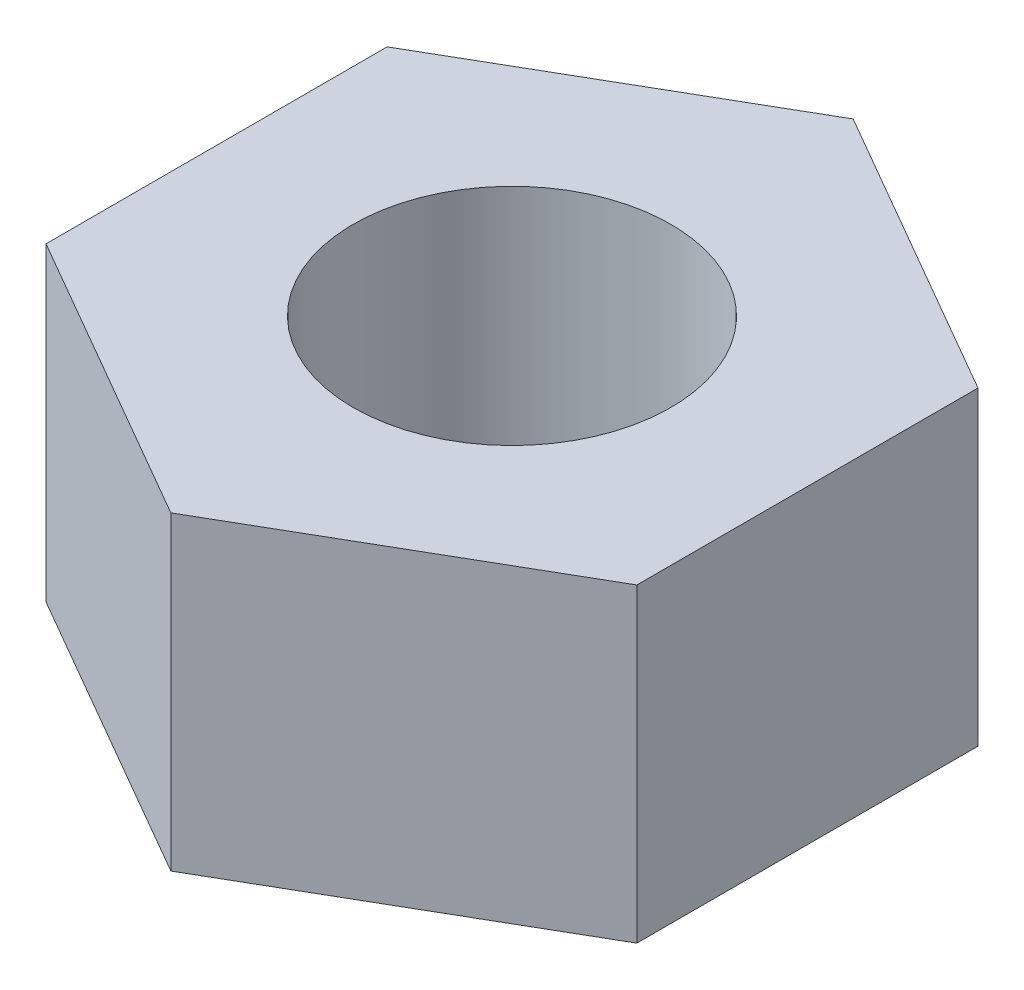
ISO-10303-21;
HEADER;
FILE_DESCRIPTION(('STEP AP214'),'2;1');
FILE_NAME('part.step','',(''),(''),'','','');
FILE_SCHEMA(('AUTOMOTIVE_DESIGN { 1 0 10303 214 1 1 1 1 }'));
ENDSEC;
DATA;
#1=APPLICATION_CONTEXT('core data for automotive mechanical design processes');
#2=APPLICATION_PROTOCOL_DEFINITION('international standard','automotive_design',2000,#1);
#3=PRODUCT_CONTEXT('',#1,'mechanical');
#4=PRODUCT('Part','Part','',(#3));
#5=PRODUCT_RELATED_PRODUCT_CATEGORY('part','',(#4));
#6=PRODUCT_DEFINITION_FORMATION('','',#4);
#7=PRODUCT_DEFINITION_CONTEXT('part definition',#1,'design');
#8=PRODUCT_DEFINITION('design','',#6,#7);
#9=PRODUCT_DEFINITION_SHAPE('','',#8);
#10=(LENGTH_UNIT() NAMED_UNIT(*) SI_UNIT(.MILLI.,.METRE.));
#11=(NAMED_UNIT(*) PLANE_ANGLE_UNIT() SI_UNIT($,.RADIAN.));
#12=(NAMED_UNIT(*) SI_UNIT($,.STERADIAN.) SOLID_ANGLE_UNIT());
#13=UNCERTAINTY_MEASURE_WITH_UNIT(LENGTH_MEASURE(1.E-05),#10,'distance_accuracy_value','');
#14=(GEOMETRIC_REPRESENTATION_CONTEXT(3) GLOBAL_UNCERTAINTY_ASSIGNED_CONTEXT((#13)) GLOBAL_UNIT_ASSIGNED_CONTEXT((#10,
#11,#12)) REPRESENTATION_CONTEXT('',''));
#15=CARTESIAN_POINT('',(0.,0.,0.));
#16=DIRECTION('',(0.,0.,1.));
#17=DIRECTION('',(1.,0.,0.));
#18=AXIS2_PLACEMENT_3D('',#15,#16,#17);
#19=CARTESIAN_POINT('',(0.,5.334,-5.86587873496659));
#20=DIRECTION('',(0.,1.,0.));
#21=DIRECTION('',(0.,0.,1.));
#22=AXIS2_PLACEMENT_3D('',#19,#20,#21);
#23=PLANE('',#22);
#24=DIRECTION('',(-0.866025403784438,0.,-0.5));
#25=VECTOR('',#24,1.);
#26=CARTESIAN_POINT('',(5.07999999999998,5.334,-2.93293936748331));
#27=LINE('',#26,#25);
#28=CARTESIAN_POINT('',(5.07999999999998,5.334,-2.93293936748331));
#29=VERTEX_POINT('',#28);
#30=CARTESIAN_POINT('',(0.,5.334,-5.86587873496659));
#31=VERTEX_POINT('',#30);
#32=EDGE_CURVE('E128',#29,#31,#27,.T.);
#33=ORIENTED_EDGE('',*,*,#32,.T.);
#34=DIRECTION('',(-0.866025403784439,0.,0.5));
#35=VECTOR('',#34,1.);
#36=CARTESIAN_POINT('',(0.,5.334,-5.86587873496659));
#37=LINE('',#36,#35);
#38=CARTESIAN_POINT('',(-5.08,5.334,-2.93293936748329));
#39=VERTEX_POINT('',#38);
#40=EDGE_CURVE('E86',#31,#39,#37,.T.);
#41=ORIENTED_EDGE('',*,*,#40,.T.);
#42=DIRECTION('',(0.,0.,1.));
#43=VECTOR('',#42,1.);
#44=CARTESIAN_POINT('',(-5.08,5.334,-2.93293936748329));
#45=LINE('',#44,#43);
#46=CARTESIAN_POINT('',(-5.08,5.334,2.93293936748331));
#47=VERTEX_POINT('',#46);
#48=EDGE_CURVE('E99',#39,#47,#45,.T.);
#49=ORIENTED_EDGE('',*,*,#48,.T.);
#50=DIRECTION('',(0.866025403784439,0.,0.5));
#51=VECTOR('',#50,1.);
#52=CARTESIAN_POINT('',(-5.08,5.334,2.93293936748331));
#53=LINE('',#52,#51);
#54=CARTESIAN_POINT('',(0.,5.334,5.86587873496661));
#55=VERTEX_POINT('',#54);
#56=EDGE_CURVE('E93',#47,#55,#53,.T.);
#57=ORIENTED_EDGE('',*,*,#56,.T.);
#58=DIRECTION('',(0.866025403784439,0.,-0.5));
#59=VECTOR('',#58,1.);
#60=CARTESIAN_POINT('',(0.,5.334,5.86587873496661));
#61=LINE('',#60,#59);
#62=CARTESIAN_POINT('',(5.07999999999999,5.334,2.93293936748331));
#63=VERTEX_POINT('',#62);
#64=EDGE_CURVE('E97',#55,#63,#61,.T.);
#65=ORIENTED_EDGE('',*,*,#64,.T.);
#66=DIRECTION('',(0.,0.,-1.));
#67=VECTOR('',#66,1.);
#68=CARTESIAN_POINT('',(5.07999999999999,5.334,2.93293936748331));
#69=LINE('',#68,#67);
#70=EDGE_CURVE('E49',#63,#29,#69,.T.);
#71=ORIENTED_EDGE('',*,*,#70,.T.);
#72=EDGE_LOOP('',(#33,#41,#49,#57,#65,#71));
#73=FACE_BOUND('',#72,.T.);
#74=CARTESIAN_POINT('',(0.,5.334,0.));
#75=DIRECTION('',(0.,1.,0.));
#76=DIRECTION('',(0.,0.,1.));
#77=AXIS2_PLACEMENT_3D('',#74,#75,#76);
#78=CIRCLE('',#77,2.7305);
#79=CARTESIAN_POINT('',(0.,5.334,2.7305));
#80=VERTEX_POINT('',#79);
#81=EDGE_CURVE('E121',#80,#80,#78,.T.);
#82=ORIENTED_EDGE('',*,*,#81,.F.);
#83=EDGE_LOOP('',(#82));
#84=FACE_BOUND('',#83,.T.);
#85=ADVANCED_FACE('F32',(#73,#84),#23,.T.);
#86=CARTESIAN_POINT('',(0.,0.,-5.86587873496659));
#87=DIRECTION('',(0.,1.,0.));
#88=DIRECTION('',(0.,0.,1.));
#89=AXIS2_PLACEMENT_3D('',#86,#87,#88);
#90=PLANE('',#89);
#91=DIRECTION('',(-0.866025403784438,0.,-0.5));
#92=VECTOR('',#91,1.);
#93=CARTESIAN_POINT('',(5.07999999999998,0.,-2.93293936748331));
#94=LINE('',#93,#92);
#95=CARTESIAN_POINT('',(5.07999999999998,0.,-2.93293936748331));
#96=VERTEX_POINT('',#95);
#97=CARTESIAN_POINT('',(0.,0.,-5.86587873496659));
#98=VERTEX_POINT('',#97);
#99=EDGE_CURVE('E117',#96,#98,#94,.T.);
#100=ORIENTED_EDGE('',*,*,#99,.F.);
#101=DIRECTION('',(0.,0.,-1.));
#102=VECTOR('',#101,1.);
#103=CARTESIAN_POINT('',(5.07999999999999,0.,2.93293936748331));
#104=LINE('',#103,#102);
#105=CARTESIAN_POINT('',(5.07999999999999,0.,2.93293936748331));
#106=VERTEX_POINT('',#105);
#107=EDGE_CURVE('E78',#106,#96,#104,.T.);
#108=ORIENTED_EDGE('',*,*,#107,.F.);
#109=DIRECTION('',(0.866025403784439,0.,-0.5));
#110=VECTOR('',#109,1.);
#111=CARTESIAN_POINT('',(0.,0.,5.86587873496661));
#112=LINE('',#111,#110);
#113=CARTESIAN_POINT('',(0.,0.,5.86587873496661));
#114=VERTEX_POINT('',#113);
#115=EDGE_CURVE('E72',#114,#106,#112,.T.);
#116=ORIENTED_EDGE('',*,*,#115,.F.);
#117=DIRECTION('',(0.866025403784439,0.,0.5));
#118=VECTOR('',#117,1.);
#119=CARTESIAN_POINT('',(-5.08,0.,2.93293936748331));
#120=LINE('',#119,#118);
#121=CARTESIAN_POINT('',(-5.08,0.,2.93293936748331));
#122=VERTEX_POINT('',#121);
#123=EDGE_CURVE('E107',#122,#114,#120,.T.);
#124=ORIENTED_EDGE('',*,*,#123,.F.);
#125=DIRECTION('',(0.,0.,1.));
#126=VECTOR('',#125,1.);
#127=CARTESIAN_POINT('',(-5.08,0.,-2.93293936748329));
#128=LINE('',#127,#126);
#129=CARTESIAN_POINT('',(-5.08,0.,-2.93293936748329));
#130=VERTEX_POINT('',#129);
#131=EDGE_CURVE('E123',#130,#122,#128,.T.);
#132=ORIENTED_EDGE('',*,*,#131,.F.);
#133=DIRECTION('',(-0.866025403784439,0.,0.5));
#134=VECTOR('',#133,1.);
#135=CARTESIAN_POINT('',(0.,0.,-5.86587873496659));
#136=LINE('',#135,#134);
#137=EDGE_CURVE('E120',#98,#130,#136,.T.);
#138=ORIENTED_EDGE('',*,*,#137,.F.);
#139=EDGE_LOOP('',(#100,#108,#116,#124,#132,#138));
#140=FACE_BOUND('',#139,.T.);
#141=CARTESIAN_POINT('',(0.,0.,0.));
#142=DIRECTION('',(0.,1.,0.));
#143=DIRECTION('',(0.,0.,1.));
#144=AXIS2_PLACEMENT_3D('',#141,#142,#143);
#145=CIRCLE('',#144,2.7305);
#146=CARTESIAN_POINT('',(0.,0.,2.7305));
#147=VERTEX_POINT('',#146);
#148=EDGE_CURVE('E221',#147,#147,#145,.T.);
#149=ORIENTED_EDGE('',*,*,#148,.T.);
#150=EDGE_LOOP('',(#149));
#151=FACE_BOUND('',#150,.T.);
#152=ADVANCED_FACE('F137',(#140,#151),#90,.F.);
#153=CARTESIAN_POINT('',(5.07999999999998,5.334,-2.93293936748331));
#154=DIRECTION('',(-0.5,0.,0.866025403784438));
#155=DIRECTION('',(0.866025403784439,0.,0.5));
#156=AXIS2_PLACEMENT_3D('',#153,#154,#155);
#157=PLANE('',#156);
#158=ORIENTED_EDGE('',*,*,#99,.T.);
#159=DIRECTION('',(0.,-1.,0.));
#160=VECTOR('',#159,1.);
#161=CARTESIAN_POINT('',(0.,5.334,-5.86587873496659));
#162=LINE('',#161,#160);
#163=EDGE_CURVE('E11',#31,#98,#162,.T.);
#164=ORIENTED_EDGE('',*,*,#163,.F.);
#165=ORIENTED_EDGE('',*,*,#32,.F.);
#166=DIRECTION('',(0.,-1.,0.));
#167=VECTOR('',#166,1.);
#168=CARTESIAN_POINT('',(5.07999999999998,5.334,-2.93293936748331));
#169=LINE('',#168,#167);
#170=EDGE_CURVE('E113',#29,#96,#169,.T.);
#171=ORIENTED_EDGE('',*,*,#170,.T.);
#172=EDGE_LOOP('',(#158,#164,#165,#171));
#173=FACE_BOUND('',#172,.T.);
#174=ADVANCED_FACE('F34',(#173),#157,.F.);
#175=CARTESIAN_POINT('',(0.,5.334,-5.86587873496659));
#176=DIRECTION('',(0.5,0.,0.866025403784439));
#177=DIRECTION('',(0.866025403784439,0.,-0.5));
#178=AXIS2_PLACEMENT_3D('',#175,#176,#177);
#179=PLANE('',#178);
#180=ORIENTED_EDGE('',*,*,#137,.T.);
#181=DIRECTION('',(0.,-1.,0.));
#182=VECTOR('',#181,1.);
#183=CARTESIAN_POINT('',(-5.08,5.334,-2.93293936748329));
#184=LINE('',#183,#182);
#185=EDGE_CURVE('E41',#39,#130,#184,.T.);
#186=ORIENTED_EDGE('',*,*,#185,.F.);
#187=ORIENTED_EDGE('',*,*,#40,.F.);
#188=ORIENTED_EDGE('',*,*,#163,.T.);
#189=EDGE_LOOP('',(#180,#186,#187,#188));
#190=FACE_BOUND('',#189,.T.);
#191=ADVANCED_FACE('F162',(#190),#179,.F.);
#192=CARTESIAN_POINT('',(-5.08,5.334,-2.93293936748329));
#193=DIRECTION('',(1.,0.,0.));
#194=DIRECTION('',(0.,0.,-1.));
#195=AXIS2_PLACEMENT_3D('',#192,#193,#194);
#196=PLANE('',#195);
#197=ORIENTED_EDGE('',*,*,#131,.T.);
#198=DIRECTION('',(0.,-1.,0.));
#199=VECTOR('',#198,1.);
#200=CARTESIAN_POINT('',(-5.08,5.334,2.93293936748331));
#201=LINE('',#200,#199);
#202=EDGE_CURVE('E108',#47,#122,#201,.T.);
#203=ORIENTED_EDGE('',*,*,#202,.F.);
#204=ORIENTED_EDGE('',*,*,#48,.F.);
#205=ORIENTED_EDGE('',*,*,#185,.T.);
#206=EDGE_LOOP('',(#197,#203,#204,#205));
#207=FACE_BOUND('',#206,.T.);
#208=ADVANCED_FACE('F134',(#207),#196,.F.);
#209=CARTESIAN_POINT('',(-5.08,5.334,2.93293936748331));
#210=DIRECTION('',(0.5,0.,-0.866025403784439));
#211=DIRECTION('',(-0.866025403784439,0.,-0.5));
#212=AXIS2_PLACEMENT_3D('',#209,#210,#211);
#213=PLANE('',#212);
#214=ORIENTED_EDGE('',*,*,#123,.T.);
#215=DIRECTION('',(0.,-1.,0.));
#216=VECTOR('',#215,1.);
#217=CARTESIAN_POINT('',(0.,5.334,5.86587873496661));
#218=LINE('',#217,#216);
#219=EDGE_CURVE('E104',#55,#114,#218,.T.);
#220=ORIENTED_EDGE('',*,*,#219,.F.);
#221=ORIENTED_EDGE('',*,*,#56,.F.);
#222=ORIENTED_EDGE('',*,*,#202,.T.);
#223=EDGE_LOOP('',(#214,#220,#221,#222));
#224=FACE_BOUND('',#223,.T.);
#225=ADVANCED_FACE('F105',(#224),#213,.F.);
#226=CARTESIAN_POINT('',(0.,5.334,5.86587873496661));
#227=DIRECTION('',(-0.5,0.,-0.866025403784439));
#228=DIRECTION('',(-0.866025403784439,0.,0.5));
#229=AXIS2_PLACEMENT_3D('',#226,#227,#228);
#230=PLANE('',#229);
#231=ORIENTED_EDGE('',*,*,#115,.T.);
#232=DIRECTION('',(0.,-1.,0.));
#233=VECTOR('',#232,1.);
#234=CARTESIAN_POINT('',(5.07999999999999,5.334,2.93293936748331));
#235=LINE('',#234,#233);
#236=EDGE_CURVE('E109',#63,#106,#235,.T.);
#237=ORIENTED_EDGE('',*,*,#236,.F.);
#238=ORIENTED_EDGE('',*,*,#64,.F.);
#239=ORIENTED_EDGE('',*,*,#219,.T.);
#240=EDGE_LOOP('',(#231,#237,#238,#239));
#241=FACE_BOUND('',#240,.T.);
#242=ADVANCED_FACE('F111',(#241),#230,.F.);
#243=CARTESIAN_POINT('',(5.07999999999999,5.334,2.93293936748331));
#244=DIRECTION('',(-1.,0.,0.));
#245=DIRECTION('',(0.,0.,1.));
#246=AXIS2_PLACEMENT_3D('',#243,#244,#245);
#247=PLANE('',#246);
#248=ORIENTED_EDGE('',*,*,#107,.T.);
#249=ORIENTED_EDGE('',*,*,#170,.F.);
#250=ORIENTED_EDGE('',*,*,#70,.F.);
#251=ORIENTED_EDGE('',*,*,#236,.T.);
#252=EDGE_LOOP('',(#248,#249,#250,#251));
#253=FACE_BOUND('',#252,.T.);
#254=ADVANCED_FACE('F142',(#253),#247,.F.);
#255=CARTESIAN_POINT('',(0.,5.334,0.));
#256=DIRECTION('',(0.,-1.,0.));
#257=DIRECTION('',(0.,0.,-1.));
#258=AXIS2_PLACEMENT_3D('',#255,#256,#257);
#259=CYLINDRICAL_SURFACE('',#258,2.7305);
#260=ORIENTED_EDGE('',*,*,#81,.T.);
#261=EDGE_LOOP('',(#260));
#262=FACE_BOUND('',#261,.T.);
#263=ORIENTED_EDGE('',*,*,#148,.F.);
#264=EDGE_LOOP('',(#263));
#265=FACE_BOUND('',#264,.T.);
#266=ADVANCED_FACE('F144',(#262,#265),#259,.F.);
#267=CLOSED_SHELL('',(#85,#152,#174,#191,#208,#225,#242,#254,#266));
#268=MANIFOLD_SOLID_BREP('B2',#267);
#269=ADVANCED_BREP_SHAPE_REPRESENTATION('',(#18,#268),#14);
#270=SHAPE_DEFINITION_REPRESENTATION(#9,#269);
ENDSEC;
END-ISO-10303-21;
